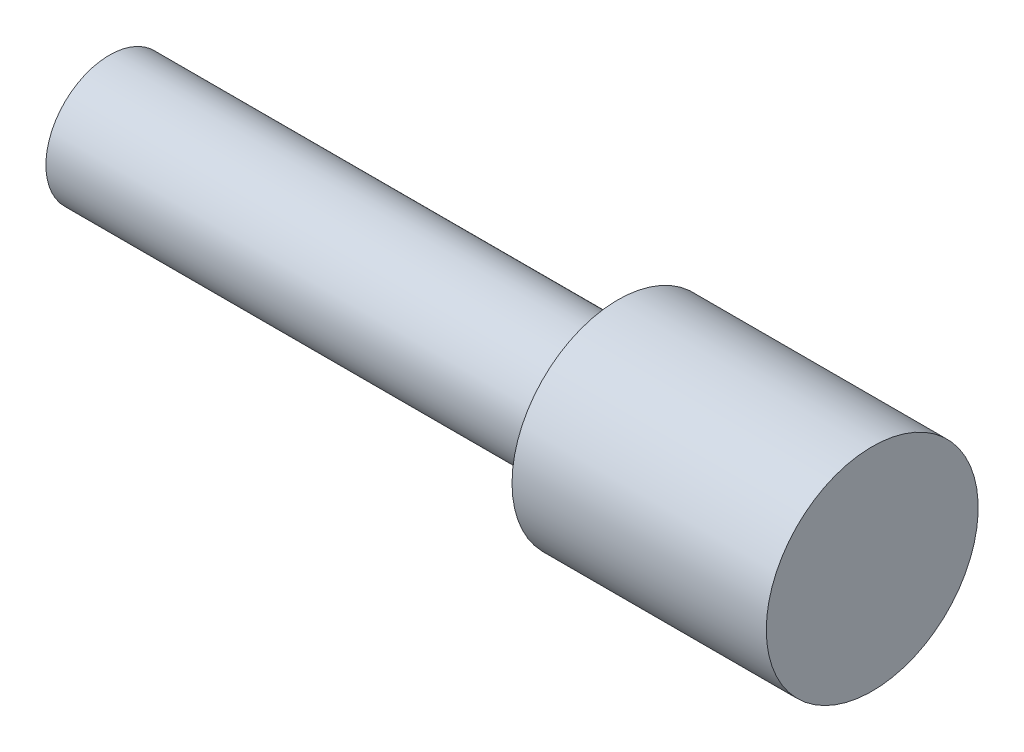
ISO-10303-21;
HEADER;
FILE_DESCRIPTION(('STEP AP214'),'2;1');
FILE_NAME('part.step','',(''),(''),'','','');
FILE_SCHEMA(('AUTOMOTIVE_DESIGN { 1 0 10303 214 1 1 1 1 }'));
ENDSEC;
DATA;
#1=APPLICATION_CONTEXT('core data for automotive mechanical design processes');
#2=APPLICATION_PROTOCOL_DEFINITION('international standard','automotive_design',2000,#1);
#3=PRODUCT_CONTEXT('',#1,'mechanical');
#4=PRODUCT('Part','Part','',(#3));
#5=PRODUCT_RELATED_PRODUCT_CATEGORY('part','',(#4));
#6=PRODUCT_DEFINITION_FORMATION('','',#4);
#7=PRODUCT_DEFINITION_CONTEXT('part definition',#1,'design');
#8=PRODUCT_DEFINITION('design','',#6,#7);
#9=PRODUCT_DEFINITION_SHAPE('','',#8);
#10=(LENGTH_UNIT() NAMED_UNIT(*) SI_UNIT(.MILLI.,.METRE.));
#11=(NAMED_UNIT(*) PLANE_ANGLE_UNIT() SI_UNIT($,.RADIAN.));
#12=(NAMED_UNIT(*) SI_UNIT($,.STERADIAN.) SOLID_ANGLE_UNIT());
#13=UNCERTAINTY_MEASURE_WITH_UNIT(LENGTH_MEASURE(1.E-05),#10,'distance_accuracy_value','');
#14=(GEOMETRIC_REPRESENTATION_CONTEXT(3) GLOBAL_UNCERTAINTY_ASSIGNED_CONTEXT((#13)) GLOBAL_UNIT_ASSIGNED_CONTEXT((#10,
#11,#12)) REPRESENTATION_CONTEXT('',''));
#15=CARTESIAN_POINT('',(0.,0.,0.));
#16=DIRECTION('',(0.,0.,1.));
#17=DIRECTION('',(1.,0.,0.));
#18=AXIS2_PLACEMENT_3D('',#15,#16,#17);
#19=CARTESIAN_POINT('',(-152.399999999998,0.,0.));
#20=DIRECTION('',(1.,0.,0.));
#21=DIRECTION('',(0.,0.,-1.00000000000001));
#22=AXIS2_PLACEMENT_3D('',#19,#20,#21);
#23=CYLINDRICAL_SURFACE('',#22,19.05);
#24=CARTESIAN_POINT('',(-152.399999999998,0.,0.));
#25=DIRECTION('',(1.,0.,0.));
#26=DIRECTION('',(0.,0.,-1.00000000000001));
#27=AXIS2_PLACEMENT_3D('',#24,#25,#26);
#28=CIRCLE('',#27,19.05);
#29=CARTESIAN_POINT('',(-152.399999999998,0.,-19.0500000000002));
#30=VERTEX_POINT('',#29);
#31=EDGE_CURVE('E12',#30,#30,#28,.T.);
#32=CARTESIAN_POINT('',(0.,0.,0.));
#33=DIRECTION('',(1.,0.,0.));
#34=DIRECTION('',(0.,0.,-1.00000000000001));
#35=AXIS2_PLACEMENT_3D('',#32,#33,#34);
#36=CIRCLE('',#35,19.05);
#37=CARTESIAN_POINT('',(0.,0.,-19.0500000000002));
#38=VERTEX_POINT('',#37);
#39=EDGE_CURVE('E45',#38,#38,#36,.T.);
#40=CARTESIAN_POINT('',(-152.399999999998,0.,-19.0500000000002));
#41=CARTESIAN_POINT('',(-150.812499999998,0.,-19.0500000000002));
#42=CARTESIAN_POINT('',(-149.224999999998,0.,-19.0500000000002));
#43=CARTESIAN_POINT('',(-146.049999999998,0.,-19.0500000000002));
#44=CARTESIAN_POINT('',(-144.462499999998,0.,-19.0500000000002));
#45=CARTESIAN_POINT('',(-141.287499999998,0.,-19.0500000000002));
#46=CARTESIAN_POINT('',(-139.699999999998,0.,-19.0500000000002));
#47=CARTESIAN_POINT('',(-136.524999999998,0.,-19.0500000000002));
#48=CARTESIAN_POINT('',(-134.937499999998,0.,-19.0500000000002));
#49=CARTESIAN_POINT('',(-131.762499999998,0.,-19.0500000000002));
#50=CARTESIAN_POINT('',(-130.174999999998,0.,-19.0500000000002));
#51=CARTESIAN_POINT('',(-126.999999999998,0.,-19.0500000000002));
#52=CARTESIAN_POINT('',(-125.412499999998,0.,-19.0500000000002));
#53=CARTESIAN_POINT('',(-122.237499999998,0.,-19.0500000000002));
#54=CARTESIAN_POINT('',(-120.649999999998,0.,-19.0500000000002));
#55=CARTESIAN_POINT('',(-117.474999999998,0.,-19.0500000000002));
#56=CARTESIAN_POINT('',(-115.887499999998,0.,-19.0500000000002));
#57=CARTESIAN_POINT('',(-112.712499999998,0.,-19.0500000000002));
#58=CARTESIAN_POINT('',(-111.124999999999,0.,-19.0500000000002));
#59=CARTESIAN_POINT('',(-107.949999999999,0.,-19.0500000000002));
#60=CARTESIAN_POINT('',(-106.362499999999,0.,-19.0500000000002));
#61=CARTESIAN_POINT('',(-103.187499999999,0.,-19.0500000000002));
#62=CARTESIAN_POINT('',(-101.599999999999,0.,-19.0500000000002));
#63=CARTESIAN_POINT('',(-98.4249999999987,0.,-19.0500000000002));
#64=CARTESIAN_POINT('',(-96.8374999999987,0.,-19.0500000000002));
#65=CARTESIAN_POINT('',(-93.6624999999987,0.,-19.0500000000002));
#66=CARTESIAN_POINT('',(-92.0749999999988,0.,-19.0500000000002));
#67=CARTESIAN_POINT('',(-88.8999999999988,0.,-19.0500000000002));
#68=CARTESIAN_POINT('',(-87.3124999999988,0.,-19.0500000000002));
#69=CARTESIAN_POINT('',(-84.1374999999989,0.,-19.0500000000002));
#70=CARTESIAN_POINT('',(-82.5499999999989,0.,-19.0500000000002));
#71=CARTESIAN_POINT('',(-79.3749999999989,0.,-19.0500000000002));
#72=CARTESIAN_POINT('',(-77.787499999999,0.,-19.0500000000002));
#73=CARTESIAN_POINT('',(-74.612499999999,0.,-19.0500000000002));
#74=CARTESIAN_POINT('',(-73.024999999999,0.,-19.0500000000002));
#75=CARTESIAN_POINT('',(-69.8499999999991,0.,-19.0500000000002));
#76=CARTESIAN_POINT('',(-68.2624999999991,0.,-19.0500000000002));
#77=CARTESIAN_POINT('',(-65.0874999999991,0.,-19.0500000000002));
#78=CARTESIAN_POINT('',(-63.4999999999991,0.,-19.0500000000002));
#79=CARTESIAN_POINT('',(-60.3249999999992,0.,-19.0500000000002));
#80=CARTESIAN_POINT('',(-58.7374999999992,0.,-19.0500000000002));
#81=CARTESIAN_POINT('',(-55.5624999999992,0.,-19.0500000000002));
#82=CARTESIAN_POINT('',(-53.9749999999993,0.,-19.0500000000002));
#83=CARTESIAN_POINT('',(-50.7999999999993,0.,-19.0500000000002));
#84=CARTESIAN_POINT('',(-49.2124999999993,0.,-19.0500000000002));
#85=CARTESIAN_POINT('',(-46.0374999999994,0.,-19.0500000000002));
#86=CARTESIAN_POINT('',(-44.4499999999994,0.,-19.0500000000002));
#87=CARTESIAN_POINT('',(-41.2749999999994,0.,-19.0500000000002));
#88=CARTESIAN_POINT('',(-39.6874999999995,0.,-19.0500000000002));
#89=CARTESIAN_POINT('',(-36.5124999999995,0.,-19.0500000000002));
#90=CARTESIAN_POINT('',(-34.9249999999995,0.,-19.0500000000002));
#91=CARTESIAN_POINT('',(-31.7499999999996,0.,-19.0500000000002));
#92=CARTESIAN_POINT('',(-30.1624999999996,0.,-19.0500000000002));
#93=CARTESIAN_POINT('',(-26.9874999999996,0.,-19.0500000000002));
#94=CARTESIAN_POINT('',(-25.3999999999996,0.,-19.0500000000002));
#95=CARTESIAN_POINT('',(-22.2249999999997,0.,-19.0500000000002));
#96=CARTESIAN_POINT('',(-20.6374999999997,0.,-19.0500000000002));
#97=CARTESIAN_POINT('',(-17.4624999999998,0.,-19.0500000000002));
#98=CARTESIAN_POINT('',(-15.8749999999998,0.,-19.0500000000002));
#99=CARTESIAN_POINT('',(-12.6999999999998,0.,-19.0500000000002));
#100=CARTESIAN_POINT('',(-11.1124999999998,0.,-19.0500000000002));
#101=CARTESIAN_POINT('',(-7.93749999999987,0.,-19.0500000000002));
#102=CARTESIAN_POINT('',(-6.34999999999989,0.,-19.0500000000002));
#103=CARTESIAN_POINT('',(-3.17499999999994,0.,-19.0500000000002));
#104=CARTESIAN_POINT('',(-1.58749999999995,0.,-19.0500000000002));
#105=CARTESIAN_POINT('',(0.,0.,-19.0500000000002));
#106=B_SPLINE_CURVE_WITH_KNOTS('',3,(#40,#41,#42,#43,#44,#45,#46,#47,#48,#49,#50,#51,#52,#53,
#54,#55,#56,#57,#58,#59,#60,#61,#62,#63,#64,#65,#66,#67,#68,#69,#70,#71,#72,#73,#74,#75,#76,#77,
#78,#79,#80,#81,#82,#83,#84,#85,#86,#87,#88,#89,#90,#91,#92,#93,#94,#95,#96,#97,#98,#99,#100,
#101,#102,#103,#104,#105),.UNSPECIFIED.,.F.,.F.,(4,2,2,2,2,2,2,2,2,2,2,2,2,2,2,2,2,2,2,2,2,2,2,
2,2,2,2,2,2,2,2,2,4),(0.,4.76249999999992,9.52499999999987,14.2874999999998,19.0499999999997,
23.8124999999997,28.5749999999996,33.3374999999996,38.0999999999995,42.8624999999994,
47.6249999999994,52.3874999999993,57.1499999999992,61.9124999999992,66.6749999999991,
71.437499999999,76.199999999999,80.9624999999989,85.7249999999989,90.4874999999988,
95.2499999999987,100.012499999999,104.774999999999,109.537499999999,114.299999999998,
119.062499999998,123.824999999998,128.587499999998,133.349999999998,138.112499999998,
142.874999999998,147.637499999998,152.399999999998),.UNSPECIFIED.);
#107=EDGE_CURVE('BSEAM42',#30,#38,#106,.T.);
#108=ORIENTED_EDGE('',*,*,#31,.T.);
#109=ORIENTED_EDGE('',*,*,#39,.F.);
#110=ORIENTED_EDGE('',*,*,#107,.T.);
#111=ORIENTED_EDGE('',*,*,#107,.F.);
#112=EDGE_LOOP('',(#108,#110,#109,#111));
#113=FACE_BOUND('',#112,.T.);
#114=ADVANCED_FACE('F42',(#113),#23,.T.);
#115=CARTESIAN_POINT('',(-152.399999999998,0.,0.));
#116=DIRECTION('',(1.,0.,0.));
#117=DIRECTION('',(0.,0.,-1.00000000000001));
#118=AXIS2_PLACEMENT_3D('',#115,#116,#117);
#119=PLANE('',#118);
#120=ORIENTED_EDGE('',*,*,#31,.F.);
#121=EDGE_LOOP('',(#120));
#122=FACE_BOUND('',#121,.T.);
#123=ADVANCED_FACE('F65',(#122),#119,.F.);
#124=CARTESIAN_POINT('',(76.2,0.,0.));
#125=DIRECTION('',(-1.,0.,0.));
#126=DIRECTION('',(0.,0.,1.00000000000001));
#127=AXIS2_PLACEMENT_3D('',#124,#125,#126);
#128=CYLINDRICAL_SURFACE('',#127,31.75);
#129=CARTESIAN_POINT('',(76.2,0.,0.));
#130=DIRECTION('',(1.,0.,0.));
#131=DIRECTION('',(0.,0.,-1.00000000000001));
#132=AXIS2_PLACEMENT_3D('',#129,#130,#131);
#133=CIRCLE('',#132,31.75);
#134=CARTESIAN_POINT('',(76.2,0.,31.7500000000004));
#135=VERTEX_POINT('',#134);
#136=EDGE_CURVE('E52',#135,#135,#133,.T.);
#137=CARTESIAN_POINT('',(0.,0.,0.));
#138=DIRECTION('',(1.,0.,0.));
#139=DIRECTION('',(0.,0.,-1.00000000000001));
#140=AXIS2_PLACEMENT_3D('',#137,#138,#139);
#141=CIRCLE('',#140,31.75);
#142=CARTESIAN_POINT('',(0.,0.,31.7500000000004));
#143=VERTEX_POINT('',#142);
#144=EDGE_CURVE('E54',#143,#143,#141,.T.);
#145=CARTESIAN_POINT('',(76.2,0.,31.7500000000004));
#146=CARTESIAN_POINT('',(75.40625,0.,31.7500000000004));
#147=CARTESIAN_POINT('',(74.6125,0.,31.7500000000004));
#148=CARTESIAN_POINT('',(73.025,0.,31.7500000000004));
#149=CARTESIAN_POINT('',(72.23125,0.,31.7500000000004));
#150=CARTESIAN_POINT('',(70.64375,0.,31.7500000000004));
#151=CARTESIAN_POINT('',(69.85,0.,31.7500000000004));
#152=CARTESIAN_POINT('',(68.2625,0.,31.7500000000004));
#153=CARTESIAN_POINT('',(67.46875,0.,31.7500000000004));
#154=CARTESIAN_POINT('',(65.88125,0.,31.7500000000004));
#155=CARTESIAN_POINT('',(65.0875,0.,31.7500000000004));
#156=CARTESIAN_POINT('',(63.5,0.,31.7500000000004));
#157=CARTESIAN_POINT('',(62.70625,0.,31.7500000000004));
#158=CARTESIAN_POINT('',(61.11875,0.,31.7500000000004));
#159=CARTESIAN_POINT('',(60.325,0.,31.7500000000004));
#160=CARTESIAN_POINT('',(58.7375,0.,31.7500000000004));
#161=CARTESIAN_POINT('',(57.94375,0.,31.7500000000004));
#162=CARTESIAN_POINT('',(56.35625,0.,31.7500000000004));
#163=CARTESIAN_POINT('',(55.5625,0.,31.7500000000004));
#164=CARTESIAN_POINT('',(53.975,0.,31.7500000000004));
#165=CARTESIAN_POINT('',(53.18125,0.,31.7500000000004));
#166=CARTESIAN_POINT('',(51.59375,0.,31.7500000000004));
#167=CARTESIAN_POINT('',(50.8,0.,31.7500000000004));
#168=CARTESIAN_POINT('',(49.2125,0.,31.7500000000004));
#169=CARTESIAN_POINT('',(48.41875,0.,31.7500000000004));
#170=CARTESIAN_POINT('',(46.83125,0.,31.7500000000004));
#171=CARTESIAN_POINT('',(46.0375,0.,31.7500000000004));
#172=CARTESIAN_POINT('',(44.45,0.,31.7500000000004));
#173=CARTESIAN_POINT('',(43.65625,0.,31.7500000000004));
#174=CARTESIAN_POINT('',(42.06875,0.,31.7500000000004));
#175=CARTESIAN_POINT('',(41.275,0.,31.7500000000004));
#176=CARTESIAN_POINT('',(39.6875,0.,31.7500000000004));
#177=CARTESIAN_POINT('',(38.89375,0.,31.7500000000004));
#178=CARTESIAN_POINT('',(37.30625,0.,31.7500000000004));
#179=CARTESIAN_POINT('',(36.5125,0.,31.7500000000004));
#180=CARTESIAN_POINT('',(34.925,0.,31.7500000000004));
#181=CARTESIAN_POINT('',(34.13125,0.,31.7500000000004));
#182=CARTESIAN_POINT('',(32.54375,0.,31.7500000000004));
#183=CARTESIAN_POINT('',(31.75,0.,31.7500000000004));
#184=CARTESIAN_POINT('',(30.1625,0.,31.7500000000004));
#185=CARTESIAN_POINT('',(29.36875,0.,31.7500000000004));
#186=CARTESIAN_POINT('',(27.78125,0.,31.7500000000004));
#187=CARTESIAN_POINT('',(26.9875,0.,31.7500000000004));
#188=CARTESIAN_POINT('',(25.4,0.,31.7500000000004));
#189=CARTESIAN_POINT('',(24.60625,0.,31.7500000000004));
#190=CARTESIAN_POINT('',(23.01875,0.,31.7500000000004));
#191=CARTESIAN_POINT('',(22.225,0.,31.7500000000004));
#192=CARTESIAN_POINT('',(20.6375,0.,31.7500000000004));
#193=CARTESIAN_POINT('',(19.84375,0.,31.7500000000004));
#194=CARTESIAN_POINT('',(18.25625,0.,31.7500000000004));
#195=CARTESIAN_POINT('',(17.4625,0.,31.7500000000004));
#196=CARTESIAN_POINT('',(15.875,0.,31.7500000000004));
#197=CARTESIAN_POINT('',(15.08125,0.,31.7500000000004));
#198=CARTESIAN_POINT('',(13.49375,0.,31.7500000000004));
#199=CARTESIAN_POINT('',(12.7,0.,31.7500000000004));
#200=CARTESIAN_POINT('',(11.1125,0.,31.7500000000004));
#201=CARTESIAN_POINT('',(10.31875,0.,31.7500000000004));
#202=CARTESIAN_POINT('',(8.73124999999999,0.,31.7500000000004));
#203=CARTESIAN_POINT('',(7.93749999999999,0.,31.7500000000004));
#204=CARTESIAN_POINT('',(6.34999999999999,0.,31.7500000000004));
#205=CARTESIAN_POINT('',(5.55624999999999,0.,31.7500000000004));
#206=CARTESIAN_POINT('',(3.96874999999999,0.,31.7500000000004));
#207=CARTESIAN_POINT('',(3.17499999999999,0.,31.7500000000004));
#208=CARTESIAN_POINT('',(1.58749999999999,0.,31.7500000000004));
#209=CARTESIAN_POINT('',(0.793749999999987,0.,31.7500000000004));
#210=CARTESIAN_POINT('',(0.,0.,31.7500000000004));
#211=B_SPLINE_CURVE_WITH_KNOTS('',3,(#145,#146,#147,#148,#149,#150,#151,#152,#153,#154,#155,
#156,#157,#158,#159,#160,#161,#162,#163,#164,#165,#166,#167,#168,#169,#170,#171,#172,#173,#174,
#175,#176,#177,#178,#179,#180,#181,#182,#183,#184,#185,#186,#187,#188,#189,#190,#191,#192,#193,
#194,#195,#196,#197,#198,#199,#200,#201,#202,#203,#204,#205,#206,#207,#208,#209,#210),
.UNSPECIFIED.,.F.,.F.,(4,2,2,2,2,2,2,2,2,2,2,2,2,2,2,2,2,2,2,2,2,2,2,2,2,2,2,2,2,2,2,2,4),(0.,
2.38124999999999,4.76249999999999,7.14375,9.52499999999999,11.90625,14.2875,16.66875,19.05,
21.43125,23.8125,26.19375,28.575,30.95625,33.3375,35.71875,38.1,40.48125,42.8625,45.24375,
47.625,50.00625,52.3875,54.76875,57.15,59.53125,61.9125,64.29375,66.675,69.05625,71.4375,
73.8187500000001,76.2),.UNSPECIFIED.);
#212=EDGE_CURVE('BSEAM62',#135,#143,#211,.T.);
#213=ORIENTED_EDGE('',*,*,#136,.F.);
#214=ORIENTED_EDGE('',*,*,#144,.T.);
#215=ORIENTED_EDGE('',*,*,#212,.T.);
#216=ORIENTED_EDGE('',*,*,#212,.F.);
#217=EDGE_LOOP('',(#213,#215,#214,#216));
#218=FACE_BOUND('',#217,.T.);
#219=ADVANCED_FACE('F62',(#218),#128,.T.);
#220=CARTESIAN_POINT('',(76.2,0.,0.));
#221=DIRECTION('',(1.,0.,0.));
#222=DIRECTION('',(0.,0.,-1.00000000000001));
#223=AXIS2_PLACEMENT_3D('',#220,#221,#222);
#224=PLANE('',#223);
#225=ORIENTED_EDGE('',*,*,#136,.T.);
#226=EDGE_LOOP('',(#225));
#227=FACE_BOUND('',#226,.T.);
#228=ADVANCED_FACE('F60',(#227),#224,.T.);
#229=CARTESIAN_POINT('',(0.,0.,0.));
#230=DIRECTION('',(1.,0.,0.));
#231=DIRECTION('',(0.,0.,-1.00000000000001));
#232=AXIS2_PLACEMENT_3D('',#229,#230,#231);
#233=PLANE('',#232);
#234=ORIENTED_EDGE('',*,*,#39,.T.);
#235=EDGE_LOOP('',(#234));
#236=FACE_BOUND('',#235,.T.);
#237=ORIENTED_EDGE('',*,*,#144,.F.);
#238=EDGE_LOOP('',(#237));
#239=FACE_BOUND('',#238,.T.);
#240=ADVANCED_FACE('F69',(#236,#239),#233,.F.);
#241=CLOSED_SHELL('',(#114,#123,#219,#228,#240));
#242=MANIFOLD_SOLID_BREP('B2',#241);
#243=ADVANCED_BREP_SHAPE_REPRESENTATION('',(#18,#242),#14);
#244=SHAPE_DEFINITION_REPRESENTATION(#9,#243);
ENDSEC;
END-ISO-10303-21;
